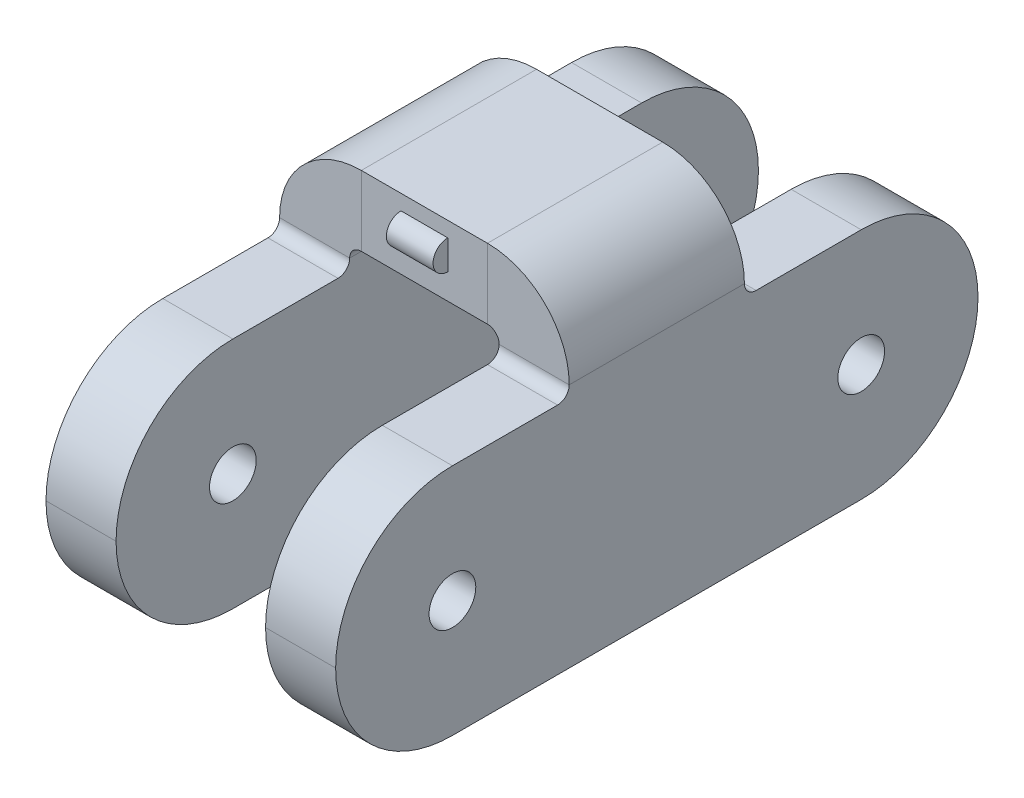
ISO-10303-21;
HEADER;
FILE_DESCRIPTION(('STEP AP214'),'2;1');
FILE_NAME('part.step','',(''),(''),'','','');
FILE_SCHEMA(('AUTOMOTIVE_DESIGN { 1 0 10303 214 1 1 1 1 }'));
ENDSEC;
DATA;
#1=APPLICATION_CONTEXT('core data for automotive mechanical design processes');
#2=APPLICATION_PROTOCOL_DEFINITION('international standard','automotive_design',2000,#1);
#3=PRODUCT_CONTEXT('',#1,'mechanical');
#4=PRODUCT('Part','Part','',(#3));
#5=PRODUCT_RELATED_PRODUCT_CATEGORY('part','',(#4));
#6=PRODUCT_DEFINITION_FORMATION('','',#4);
#7=PRODUCT_DEFINITION_CONTEXT('part definition',#1,'design');
#8=PRODUCT_DEFINITION('design','',#6,#7);
#9=PRODUCT_DEFINITION_SHAPE('','',#8);
#10=(LENGTH_UNIT() NAMED_UNIT(*) SI_UNIT(.MILLI.,.METRE.));
#11=(NAMED_UNIT(*) PLANE_ANGLE_UNIT() SI_UNIT($,.RADIAN.));
#12=(NAMED_UNIT(*) SI_UNIT($,.STERADIAN.) SOLID_ANGLE_UNIT());
#13=UNCERTAINTY_MEASURE_WITH_UNIT(LENGTH_MEASURE(1.E-05),#10,'distance_accuracy_value','');
#14=(GEOMETRIC_REPRESENTATION_CONTEXT(3) GLOBAL_UNCERTAINTY_ASSIGNED_CONTEXT((#13)) GLOBAL_UNIT_ASSIGNED_CONTEXT((#10,
#11,#12)) REPRESENTATION_CONTEXT('',''));
#15=CARTESIAN_POINT('',(0.,0.,0.));
#16=DIRECTION('',(0.,0.,1.));
#17=DIRECTION('',(1.,0.,0.));
#18=AXIS2_PLACEMENT_3D('',#15,#16,#17);
#19=CARTESIAN_POINT('',(6.20000000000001,5.,5.));
#20=DIRECTION('',(-1.,0.,0.));
#21=DIRECTION('',(0.,-1.,0.));
#22=AXIS2_PLACEMENT_3D('',#19,#20,#21);
#23=CYLINDRICAL_SURFACE('',#22,1.);
#24=CARTESIAN_POINT('',(6.20000000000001,5.,5.));
#25=DIRECTION('',(-1.,0.,0.));
#26=DIRECTION('',(0.,-1.,0.));
#27=AXIS2_PLACEMENT_3D('',#24,#25,#26);
#28=CIRCLE('',#27,1.);
#29=CARTESIAN_POINT('',(6.20000000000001,4.,5.));
#30=VERTEX_POINT('',#29);
#31=EDGE_CURVE('E393',#30,#30,#28,.T.);
#32=ORIENTED_EDGE('',*,*,#31,.F.);
#33=EDGE_LOOP('',(#32));
#34=FACE_BOUND('',#33,.T.);
#35=CARTESIAN_POINT('',(3.2,5.,5.));
#36=DIRECTION('',(1.,0.,0.));
#37=DIRECTION('',(0.,1.,0.));
#38=AXIS2_PLACEMENT_3D('',#35,#36,#37);
#39=CIRCLE('',#38,1.);
#40=CARTESIAN_POINT('',(3.2,6.,5.));
#41=VERTEX_POINT('',#40);
#42=EDGE_CURVE('E367',#41,#41,#39,.T.);
#43=ORIENTED_EDGE('',*,*,#42,.F.);
#44=EDGE_LOOP('',(#43));
#45=FACE_BOUND('',#44,.T.);
#46=ADVANCED_FACE('F28',(#34,#45),#23,.F.);
#47=CARTESIAN_POINT('',(6.19999999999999,0.,27.5));
#48=DIRECTION('',(1.,0.,0.));
#49=DIRECTION('',(0.,1.,0.));
#50=AXIS2_PLACEMENT_3D('',#47,#48,#49);
#51=PLANE('',#50);
#52=DIRECTION('',(0.,0.,-1.));
#53=VECTOR('',#52,1.);
#54=CARTESIAN_POINT('',(6.2,10.5,10.));
#55=LINE('',#54,#53);
#56=CARTESIAN_POINT('',(6.2,10.5,17.5));
#57=VERTEX_POINT('',#56);
#58=CARTESIAN_POINT('',(6.2,10.5,10.));
#59=VERTEX_POINT('',#58);
#60=EDGE_CURVE('E427',#57,#59,#55,.T.);
#61=ORIENTED_EDGE('',*,*,#60,.F.);
#62=CARTESIAN_POINT('',(6.2,10.5,18.));
#63=DIRECTION('',(1.,0.,0.));
#64=DIRECTION('',(0.,1.,0.));
#65=AXIS2_PLACEMENT_3D('',#62,#63,#64);
#66=CIRCLE('',#65,0.5);
#67=CARTESIAN_POINT('',(6.2,10.,18.));
#68=VERTEX_POINT('',#67);
#69=EDGE_CURVE('E409',#57,#68,#66,.F.);
#70=ORIENTED_EDGE('',*,*,#69,.T.);
#71=DIRECTION('',(0.,0.,1.));
#72=VECTOR('',#71,1.);
#73=CARTESIAN_POINT('',(6.2,9.99999999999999,27.5));
#74=LINE('',#73,#72);
#75=CARTESIAN_POINT('',(6.2,9.99999999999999,22.5));
#76=VERTEX_POINT('',#75);
#77=EDGE_CURVE('E412',#68,#76,#74,.T.);
#78=ORIENTED_EDGE('',*,*,#77,.T.);
#79=CARTESIAN_POINT('',(6.2,4.99999999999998,22.5));
#80=DIRECTION('',(1.,0.,0.));
#81=DIRECTION('',(0.,1.,0.));
#82=AXIS2_PLACEMENT_3D('',#79,#80,#81);
#83=CIRCLE('',#82,5.);
#84=CARTESIAN_POINT('',(6.2,4.99999999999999,27.5));
#85=VERTEX_POINT('',#84);
#86=EDGE_CURVE('E415',#76,#85,#83,.T.);
#87=ORIENTED_EDGE('',*,*,#86,.T.);
#88=CARTESIAN_POINT('',(6.2,4.99999999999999,22.5));
#89=DIRECTION('',(1.,0.,0.));
#90=DIRECTION('',(0.,1.,0.));
#91=AXIS2_PLACEMENT_3D('',#88,#89,#90);
#92=CIRCLE('',#91,5.);
#93=CARTESIAN_POINT('',(6.19999999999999,0.,22.5));
#94=VERTEX_POINT('',#93);
#95=EDGE_CURVE('E418',#85,#94,#92,.T.);
#96=ORIENTED_EDGE('',*,*,#95,.T.);
#97=DIRECTION('',(0.,0.,-1.));
#98=VECTOR('',#97,1.);
#99=CARTESIAN_POINT('',(6.19999999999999,0.,27.5));
#100=LINE('',#99,#98);
#101=CARTESIAN_POINT('',(6.19999999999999,0.,5.));
#102=VERTEX_POINT('',#101);
#103=EDGE_CURVE('E421',#94,#102,#100,.T.);
#104=ORIENTED_EDGE('',*,*,#103,.T.);
#105=CARTESIAN_POINT('',(6.2,5.,5.));
#106=DIRECTION('',(1.,0.,0.));
#107=DIRECTION('',(0.,1.,0.));
#108=AXIS2_PLACEMENT_3D('',#105,#106,#107);
#109=CIRCLE('',#108,5.);
#110=CARTESIAN_POINT('',(6.2,4.99999999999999,0.));
#111=VERTEX_POINT('',#110);
#112=EDGE_CURVE('E397',#102,#111,#109,.T.);
#113=ORIENTED_EDGE('',*,*,#112,.T.);
#114=CARTESIAN_POINT('',(6.2,5.,5.));
#115=DIRECTION('',(1.,0.,0.));
#116=DIRECTION('',(0.,1.,0.));
#117=AXIS2_PLACEMENT_3D('',#114,#115,#116);
#118=CIRCLE('',#117,5.);
#119=CARTESIAN_POINT('',(6.2,10.,5.));
#120=VERTEX_POINT('',#119);
#121=EDGE_CURVE('E400',#111,#120,#118,.T.);
#122=ORIENTED_EDGE('',*,*,#121,.T.);
#123=DIRECTION('',(0.,0.,1.));
#124=VECTOR('',#123,1.);
#125=CARTESIAN_POINT('',(6.2,9.99999999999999,0.));
#126=LINE('',#125,#124);
#127=CARTESIAN_POINT('',(6.2,9.99999999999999,9.5));
#128=VERTEX_POINT('',#127);
#129=EDGE_CURVE('E403',#120,#128,#126,.T.);
#130=ORIENTED_EDGE('',*,*,#129,.T.);
#131=CARTESIAN_POINT('',(6.2,10.5,9.5));
#132=DIRECTION('',(1.,0.,0.));
#133=DIRECTION('',(0.,1.,0.));
#134=AXIS2_PLACEMENT_3D('',#131,#132,#133);
#135=CIRCLE('',#134,0.5);
#136=EDGE_CURVE('E406',#128,#59,#135,.F.);
#137=ORIENTED_EDGE('',*,*,#136,.T.);
#138=EDGE_LOOP('',(#61,#70,#78,#87,#96,#104,#113,#122,#130,#137));
#139=FACE_BOUND('',#138,.T.);
#140=CARTESIAN_POINT('',(6.20000000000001,5.,22.5));
#141=DIRECTION('',(-1.,0.,0.));
#142=DIRECTION('',(0.,-1.,0.));
#143=AXIS2_PLACEMENT_3D('',#140,#141,#142);
#144=CIRCLE('',#143,1.);
#145=CARTESIAN_POINT('',(6.20000000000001,4.,22.5));
#146=VERTEX_POINT('',#145);
#147=EDGE_CURVE('E390',#146,#146,#144,.T.);
#148=ORIENTED_EDGE('',*,*,#147,.T.);
#149=EDGE_LOOP('',(#148));
#150=FACE_BOUND('',#149,.T.);
#151=ORIENTED_EDGE('',*,*,#31,.T.);
#152=EDGE_LOOP('',(#151));
#153=FACE_BOUND('',#152,.T.);
#154=ADVANCED_FACE('F461',(#139,#150,#153),#51,.T.);
#155=CARTESIAN_POINT('',(6.20000000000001,5.,22.5));
#156=DIRECTION('',(-1.,0.,0.));
#157=DIRECTION('',(0.,-1.,0.));
#158=AXIS2_PLACEMENT_3D('',#155,#156,#157);
#159=CYLINDRICAL_SURFACE('',#158,1.);
#160=ORIENTED_EDGE('',*,*,#147,.F.);
#161=EDGE_LOOP('',(#160));
#162=FACE_BOUND('',#161,.T.);
#163=CARTESIAN_POINT('',(3.2,4.99999999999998,22.5));
#164=DIRECTION('',(1.,0.,0.));
#165=DIRECTION('',(0.,1.,0.));
#166=AXIS2_PLACEMENT_3D('',#163,#164,#165);
#167=CIRCLE('',#166,1.);
#168=CARTESIAN_POINT('',(3.2,5.99999999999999,22.5));
#169=VERTEX_POINT('',#168);
#170=EDGE_CURVE('E364',#169,#169,#167,.T.);
#171=ORIENTED_EDGE('',*,*,#170,.F.);
#172=EDGE_LOOP('',(#171));
#173=FACE_BOUND('',#172,.T.);
#174=ADVANCED_FACE('F581',(#162,#173),#159,.F.);
#175=CARTESIAN_POINT('',(3.19999999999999,0.,27.5));
#176=DIRECTION('',(1.,0.,0.));
#177=DIRECTION('',(0.,1.,0.));
#178=AXIS2_PLACEMENT_3D('',#175,#176,#177);
#179=PLANE('',#178);
#180=ORIENTED_EDGE('',*,*,#170,.T.);
#181=EDGE_LOOP('',(#180));
#182=FACE_BOUND('',#181,.T.);
#183=ORIENTED_EDGE('',*,*,#42,.T.);
#184=EDGE_LOOP('',(#183));
#185=FACE_BOUND('',#184,.T.);
#186=CARTESIAN_POINT('',(3.2,10.5,18.));
#187=DIRECTION('',(1.,0.,0.));
#188=DIRECTION('',(0.,1.,0.));
#189=AXIS2_PLACEMENT_3D('',#186,#187,#188);
#190=CIRCLE('',#189,0.5);
#191=CARTESIAN_POINT('',(3.2,9.99999999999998,18.));
#192=VERTEX_POINT('',#191);
#193=CARTESIAN_POINT('',(3.2,10.5,17.5));
#194=VERTEX_POINT('',#193);
#195=EDGE_CURVE('E387',#192,#194,#190,.T.);
#196=ORIENTED_EDGE('',*,*,#195,.T.);
#197=DIRECTION('',(0.,0.,-1.));
#198=VECTOR('',#197,1.);
#199=CARTESIAN_POINT('',(3.2,10.5,10.));
#200=LINE('',#199,#198);
#201=CARTESIAN_POINT('',(3.2,10.5,9.99999999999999));
#202=VERTEX_POINT('',#201);
#203=EDGE_CURVE('E424',#194,#202,#200,.T.);
#204=ORIENTED_EDGE('',*,*,#203,.T.);
#205=CARTESIAN_POINT('',(3.2,10.5,9.5));
#206=DIRECTION('',(1.,0.,0.));
#207=DIRECTION('',(0.,1.,0.));
#208=AXIS2_PLACEMENT_3D('',#205,#206,#207);
#209=CIRCLE('',#208,0.5);
#210=CARTESIAN_POINT('',(3.2,10.,9.50000000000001));
#211=VERTEX_POINT('',#210);
#212=EDGE_CURVE('E370',#202,#211,#209,.T.);
#213=ORIENTED_EDGE('',*,*,#212,.T.);
#214=DIRECTION('',(0.,0.,-1.));
#215=VECTOR('',#214,1.);
#216=CARTESIAN_POINT('',(3.2,9.99999999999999,27.5));
#217=LINE('',#216,#215);
#218=CARTESIAN_POINT('',(3.2,10.,5.));
#219=VERTEX_POINT('',#218);
#220=EDGE_CURVE('E372',#211,#219,#217,.T.);
#221=ORIENTED_EDGE('',*,*,#220,.T.);
#222=CARTESIAN_POINT('',(3.2,5.,5.));
#223=DIRECTION('',(1.,0.,0.));
#224=DIRECTION('',(0.,1.,0.));
#225=AXIS2_PLACEMENT_3D('',#222,#223,#224);
#226=CIRCLE('',#225,5.);
#227=CARTESIAN_POINT('',(3.2,4.99999999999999,0.));
#228=VERTEX_POINT('',#227);
#229=EDGE_CURVE('E374',#219,#228,#226,.F.);
#230=ORIENTED_EDGE('',*,*,#229,.T.);
#231=CARTESIAN_POINT('',(3.2,5.,5.));
#232=DIRECTION('',(1.,0.,0.));
#233=DIRECTION('',(0.,1.,0.));
#234=AXIS2_PLACEMENT_3D('',#231,#232,#233);
#235=CIRCLE('',#234,5.);
#236=CARTESIAN_POINT('',(3.19999999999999,0.,5.));
#237=VERTEX_POINT('',#236);
#238=EDGE_CURVE('E376',#228,#237,#235,.F.);
#239=ORIENTED_EDGE('',*,*,#238,.T.);
#240=DIRECTION('',(0.,0.,-1.));
#241=VECTOR('',#240,1.);
#242=CARTESIAN_POINT('',(3.19999999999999,0.,27.5));
#243=LINE('',#242,#241);
#244=CARTESIAN_POINT('',(3.19999999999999,0.,22.5));
#245=VERTEX_POINT('',#244);
#246=EDGE_CURVE('E378',#245,#237,#243,.T.);
#247=ORIENTED_EDGE('',*,*,#246,.F.);
#248=CARTESIAN_POINT('',(3.2,4.99999999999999,22.5));
#249=DIRECTION('',(1.,0.,0.));
#250=DIRECTION('',(0.,1.,0.));
#251=AXIS2_PLACEMENT_3D('',#248,#249,#250);
#252=CIRCLE('',#251,5.);
#253=CARTESIAN_POINT('',(3.2,4.99999999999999,27.5));
#254=VERTEX_POINT('',#253);
#255=EDGE_CURVE('E381',#245,#254,#252,.F.);
#256=ORIENTED_EDGE('',*,*,#255,.T.);
#257=CARTESIAN_POINT('',(3.2,4.99999999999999,22.5));
#258=DIRECTION('',(1.,0.,0.));
#259=DIRECTION('',(0.,1.,0.));
#260=AXIS2_PLACEMENT_3D('',#257,#258,#259);
#261=CIRCLE('',#260,5.);
#262=CARTESIAN_POINT('',(3.2,9.99999999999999,22.5));
#263=VERTEX_POINT('',#262);
#264=EDGE_CURVE('E383',#254,#263,#261,.F.);
#265=ORIENTED_EDGE('',*,*,#264,.T.);
#266=DIRECTION('',(0.,0.,-1.));
#267=VECTOR('',#266,1.);
#268=CARTESIAN_POINT('',(3.2,10.,27.5));
#269=LINE('',#268,#267);
#270=EDGE_CURVE('E385',#263,#192,#269,.T.);
#271=ORIENTED_EDGE('',*,*,#270,.T.);
#272=EDGE_LOOP('',(#196,#204,#213,#221,#230,#239,#247,#256,#265,#271));
#273=FACE_BOUND('',#272,.T.);
#274=ADVANCED_FACE('F472',(#182,#185,#273),#179,.F.);
#275=CARTESIAN_POINT('',(-55.6727441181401,10.5,9.50000000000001));
#276=DIRECTION('',(1.,0.,0.));
#277=DIRECTION('',(0.,1.,0.));
#278=AXIS2_PLACEMENT_3D('',#275,#276,#277);
#279=CYLINDRICAL_SURFACE('',#278,0.5);
#280=ORIENTED_EDGE('',*,*,#136,.F.);
#281=DIRECTION('',(1.,0.,0.));
#282=VECTOR('',#281,1.);
#283=CARTESIAN_POINT('',(-55.6727441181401,10.,9.5));
#284=LINE('',#283,#282);
#285=EDGE_CURVE('E36',#211,#128,#284,.T.);
#286=ORIENTED_EDGE('',*,*,#285,.F.);
#287=ORIENTED_EDGE('',*,*,#212,.F.);
#288=DIRECTION('',(1.,0.,0.));
#289=VECTOR('',#288,1.);
#290=CARTESIAN_POINT('',(-55.6727441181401,10.5,10.));
#291=LINE('',#290,#289);
#292=EDGE_CURVE('E11',#202,#59,#291,.T.);
#293=ORIENTED_EDGE('',*,*,#292,.T.);
#294=EDGE_LOOP('',(#280,#286,#287,#293));
#295=FACE_BOUND('',#294,.T.);
#296=ADVANCED_FACE('F30',(#295),#279,.F.);
#297=CARTESIAN_POINT('',(-55.6727441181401,10.,27.5));
#298=DIRECTION('',(0.,-1.,0.));
#299=DIRECTION('',(1.,0.,0.));
#300=AXIS2_PLACEMENT_3D('',#297,#298,#299);
#301=PLANE('',#300);
#302=ORIENTED_EDGE('',*,*,#129,.F.);
#303=DIRECTION('',(1.,0.,0.));
#304=VECTOR('',#303,1.);
#305=CARTESIAN_POINT('',(-55.6727441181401,10.,5.));
#306=LINE('',#305,#304);
#307=EDGE_CURVE('E449',#219,#120,#306,.T.);
#308=ORIENTED_EDGE('',*,*,#307,.F.);
#309=ORIENTED_EDGE('',*,*,#220,.F.);
#310=ORIENTED_EDGE('',*,*,#285,.T.);
#311=EDGE_LOOP('',(#302,#308,#309,#310));
#312=FACE_BOUND('',#311,.T.);
#313=ADVANCED_FACE('F455',(#312),#301,.F.);
#314=CARTESIAN_POINT('',(-55.6727441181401,5.00000000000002,5.));
#315=DIRECTION('',(1.,0.,0.));
#316=DIRECTION('',(0.,1.,0.));
#317=AXIS2_PLACEMENT_3D('',#314,#315,#316);
#318=CYLINDRICAL_SURFACE('',#317,5.);
#319=ORIENTED_EDGE('',*,*,#121,.F.);
#320=DIRECTION('',(1.,0.,0.));
#321=VECTOR('',#320,1.);
#322=CARTESIAN_POINT('',(-55.6727441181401,5.00000000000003,0.));
#323=LINE('',#322,#321);
#324=EDGE_CURVE('E446',#228,#111,#323,.T.);
#325=ORIENTED_EDGE('',*,*,#324,.F.);
#326=ORIENTED_EDGE('',*,*,#229,.F.);
#327=ORIENTED_EDGE('',*,*,#307,.T.);
#328=EDGE_LOOP('',(#319,#325,#326,#327));
#329=FACE_BOUND('',#328,.T.);
#330=ADVANCED_FACE('F465',(#329),#318,.T.);
#331=CARTESIAN_POINT('',(-55.6727441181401,5.00000000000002,5.));
#332=DIRECTION('',(1.,0.,0.));
#333=DIRECTION('',(0.,1.,0.));
#334=AXIS2_PLACEMENT_3D('',#331,#332,#333);
#335=CYLINDRICAL_SURFACE('',#334,5.);
#336=ORIENTED_EDGE('',*,*,#112,.F.);
#337=DIRECTION('',(1.,0.,0.));
#338=VECTOR('',#337,1.);
#339=CARTESIAN_POINT('',(-55.6727441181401,0.,5.));
#340=LINE('',#339,#338);
#341=EDGE_CURVE('E443',#237,#102,#340,.T.);
#342=ORIENTED_EDGE('',*,*,#341,.F.);
#343=ORIENTED_EDGE('',*,*,#238,.F.);
#344=ORIENTED_EDGE('',*,*,#324,.T.);
#345=EDGE_LOOP('',(#336,#342,#343,#344));
#346=FACE_BOUND('',#345,.T.);
#347=ADVANCED_FACE('F469',(#346),#335,.T.);
#348=CARTESIAN_POINT('',(-55.6727441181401,0.,27.5));
#349=DIRECTION('',(0.,-1.,0.));
#350=DIRECTION('',(1.,0.,0.));
#351=AXIS2_PLACEMENT_3D('',#348,#349,#350);
#352=PLANE('',#351);
#353=ORIENTED_EDGE('',*,*,#341,.T.);
#354=ORIENTED_EDGE('',*,*,#103,.F.);
#355=DIRECTION('',(1.,0.,0.));
#356=VECTOR('',#355,1.);
#357=CARTESIAN_POINT('',(-55.6727441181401,0.,22.5));
#358=LINE('',#357,#356);
#359=EDGE_CURVE('E440',#245,#94,#358,.T.);
#360=ORIENTED_EDGE('',*,*,#359,.F.);
#361=ORIENTED_EDGE('',*,*,#246,.T.);
#362=EDGE_LOOP('',(#353,#354,#360,#361));
#363=FACE_BOUND('',#362,.T.);
#364=ADVANCED_FACE('F476',(#363),#352,.T.);
#365=CARTESIAN_POINT('',(-55.6727441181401,5.00000000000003,22.5));
#366=DIRECTION('',(1.,0.,0.));
#367=DIRECTION('',(0.,1.,0.));
#368=AXIS2_PLACEMENT_3D('',#365,#366,#367);
#369=CYLINDRICAL_SURFACE('',#368,5.);
#370=ORIENTED_EDGE('',*,*,#95,.F.);
#371=DIRECTION('',(1.,0.,0.));
#372=VECTOR('',#371,1.);
#373=CARTESIAN_POINT('',(-55.6727441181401,5.00000000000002,27.5));
#374=LINE('',#373,#372);
#375=EDGE_CURVE('E437',#254,#85,#374,.T.);
#376=ORIENTED_EDGE('',*,*,#375,.F.);
#377=ORIENTED_EDGE('',*,*,#255,.F.);
#378=ORIENTED_EDGE('',*,*,#359,.T.);
#379=EDGE_LOOP('',(#370,#376,#377,#378));
#380=FACE_BOUND('',#379,.T.);
#381=ADVANCED_FACE('F478',(#380),#369,.T.);
#382=CARTESIAN_POINT('',(-55.6727441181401,5.00000000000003,22.5));
#383=DIRECTION('',(1.,0.,0.));
#384=DIRECTION('',(0.,1.,0.));
#385=AXIS2_PLACEMENT_3D('',#382,#383,#384);
#386=CYLINDRICAL_SURFACE('',#385,5.);
#387=ORIENTED_EDGE('',*,*,#86,.F.);
#388=DIRECTION('',(1.,0.,0.));
#389=VECTOR('',#388,1.);
#390=CARTESIAN_POINT('',(-55.6727441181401,10.,22.5));
#391=LINE('',#390,#389);
#392=EDGE_CURVE('E434',#263,#76,#391,.T.);
#393=ORIENTED_EDGE('',*,*,#392,.F.);
#394=ORIENTED_EDGE('',*,*,#264,.F.);
#395=ORIENTED_EDGE('',*,*,#375,.T.);
#396=EDGE_LOOP('',(#387,#393,#394,#395));
#397=FACE_BOUND('',#396,.T.);
#398=ADVANCED_FACE('F483',(#397),#386,.T.);
#399=CARTESIAN_POINT('',(-55.6727441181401,10.,27.5));
#400=DIRECTION('',(0.,-1.,0.));
#401=DIRECTION('',(0.,0.,-1.));
#402=AXIS2_PLACEMENT_3D('',#399,#400,#401);
#403=PLANE('',#402);
#404=ORIENTED_EDGE('',*,*,#77,.F.);
#405=DIRECTION('',(1.,0.,0.));
#406=VECTOR('',#405,1.);
#407=CARTESIAN_POINT('',(-55.6727441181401,10.,18.));
#408=LINE('',#407,#406);
#409=EDGE_CURVE('E432',#192,#68,#408,.T.);
#410=ORIENTED_EDGE('',*,*,#409,.F.);
#411=ORIENTED_EDGE('',*,*,#270,.F.);
#412=ORIENTED_EDGE('',*,*,#392,.T.);
#413=EDGE_LOOP('',(#404,#410,#411,#412));
#414=FACE_BOUND('',#413,.T.);
#415=ADVANCED_FACE('F487',(#414),#403,.F.);
#416=CARTESIAN_POINT('',(-55.6727441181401,10.5,18.));
#417=DIRECTION('',(1.,0.,0.));
#418=DIRECTION('',(0.,1.,0.));
#419=AXIS2_PLACEMENT_3D('',#416,#417,#418);
#420=CYLINDRICAL_SURFACE('',#419,0.5);
#421=ORIENTED_EDGE('',*,*,#69,.F.);
#422=DIRECTION('',(1.,0.,0.));
#423=VECTOR('',#422,1.);
#424=CARTESIAN_POINT('',(-55.6727441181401,10.5,17.5));
#425=LINE('',#424,#423);
#426=EDGE_CURVE('E430',#194,#57,#425,.T.);
#427=ORIENTED_EDGE('',*,*,#426,.F.);
#428=ORIENTED_EDGE('',*,*,#195,.F.);
#429=ORIENTED_EDGE('',*,*,#409,.T.);
#430=EDGE_LOOP('',(#421,#427,#428,#429));
#431=FACE_BOUND('',#430,.T.);
#432=ADVANCED_FACE('F493',(#431),#420,.F.);
#433=CARTESIAN_POINT('',(6.20000000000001,5.,5.));
#434=DIRECTION('',(-1.,0.,0.));
#435=DIRECTION('',(0.,-1.,0.));
#436=AXIS2_PLACEMENT_3D('',#433,#434,#435);
#437=CYLINDRICAL_SURFACE('',#436,1.);
#438=CARTESIAN_POINT('',(-6.19999999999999,4.99999999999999,5.00000000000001));
#439=DIRECTION('',(-1.,0.,0.));
#440=DIRECTION('',(0.,-1.,0.));
#441=AXIS2_PLACEMENT_3D('',#438,#439,#440);
#442=CIRCLE('',#441,1.);
#443=CARTESIAN_POINT('',(-6.19999999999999,3.99999999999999,5.00000000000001));
#444=VERTEX_POINT('',#443);
#445=EDGE_CURVE('E302',#444,#444,#442,.T.);
#446=ORIENTED_EDGE('',*,*,#445,.T.);
#447=EDGE_LOOP('',(#446));
#448=FACE_BOUND('',#447,.T.);
#449=CARTESIAN_POINT('',(-3.2,4.99999999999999,5.00000000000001));
#450=DIRECTION('',(-1.,0.,0.));
#451=DIRECTION('',(0.,-1.,0.));
#452=AXIS2_PLACEMENT_3D('',#449,#450,#451);
#453=CIRCLE('',#452,1.);
#454=CARTESIAN_POINT('',(-3.2,3.99999999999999,5.00000000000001));
#455=VERTEX_POINT('',#454);
#456=EDGE_CURVE('E277',#455,#455,#453,.T.);
#457=ORIENTED_EDGE('',*,*,#456,.F.);
#458=EDGE_LOOP('',(#457));
#459=FACE_BOUND('',#458,.T.);
#460=ADVANCED_FACE('F602',(#448,#459),#437,.F.);
#461=CARTESIAN_POINT('',(-6.19999999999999,0.,27.5));
#462=DIRECTION('',(-1.,0.,0.));
#463=DIRECTION('',(0.,-1.,0.));
#464=AXIS2_PLACEMENT_3D('',#461,#462,#463);
#465=PLANE('',#464);
#466=DIRECTION('',(0.,0.,1.));
#467=VECTOR('',#466,1.);
#468=CARTESIAN_POINT('',(-6.2,10.5,17.5));
#469=LINE('',#468,#467);
#470=CARTESIAN_POINT('',(-6.2,10.5,10.));
#471=VERTEX_POINT('',#470);
#472=CARTESIAN_POINT('',(-6.2,10.5,17.5));
#473=VERTEX_POINT('',#472);
#474=EDGE_CURVE('E333',#471,#473,#469,.T.);
#475=ORIENTED_EDGE('',*,*,#474,.F.);
#476=CARTESIAN_POINT('',(-6.2,10.5,9.5));
#477=DIRECTION('',(-1.,0.,0.));
#478=DIRECTION('',(0.,-1.,0.));
#479=AXIS2_PLACEMENT_3D('',#476,#477,#478);
#480=CIRCLE('',#479,0.5);
#481=CARTESIAN_POINT('',(-6.2,10.,9.50000000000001));
#482=VERTEX_POINT('',#481);
#483=EDGE_CURVE('E327',#471,#482,#480,.F.);
#484=ORIENTED_EDGE('',*,*,#483,.T.);
#485=DIRECTION('',(0.,0.,1.));
#486=VECTOR('',#485,1.);
#487=CARTESIAN_POINT('',(-6.2,9.99999999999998,0.));
#488=LINE('',#487,#486);
#489=CARTESIAN_POINT('',(-6.2,9.99999999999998,5.));
#490=VERTEX_POINT('',#489);
#491=EDGE_CURVE('E305',#490,#482,#488,.T.);
#492=ORIENTED_EDGE('',*,*,#491,.F.);
#493=CARTESIAN_POINT('',(-6.19999999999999,4.99999999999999,5.00000000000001));
#494=DIRECTION('',(-1.,0.,0.));
#495=DIRECTION('',(0.,-1.,0.));
#496=AXIS2_PLACEMENT_3D('',#493,#494,#495);
#497=CIRCLE('',#496,5.);
#498=CARTESIAN_POINT('',(-6.19999999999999,4.99999999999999,0.));
#499=VERTEX_POINT('',#498);
#500=EDGE_CURVE('E308',#490,#499,#497,.T.);
#501=ORIENTED_EDGE('',*,*,#500,.T.);
#502=CARTESIAN_POINT('',(-6.19999999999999,5.,5.));
#503=DIRECTION('',(-1.,0.,0.));
#504=DIRECTION('',(0.,-1.,0.));
#505=AXIS2_PLACEMENT_3D('',#502,#503,#504);
#506=CIRCLE('',#505,5.);
#507=CARTESIAN_POINT('',(-6.19999999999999,0.,5.));
#508=VERTEX_POINT('',#507);
#509=EDGE_CURVE('E311',#499,#508,#506,.T.);
#510=ORIENTED_EDGE('',*,*,#509,.T.);
#511=DIRECTION('',(0.,0.,-1.));
#512=VECTOR('',#511,1.);
#513=CARTESIAN_POINT('',(-6.19999999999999,0.,27.5));
#514=LINE('',#513,#512);
#515=CARTESIAN_POINT('',(-6.19999999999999,0.,22.5));
#516=VERTEX_POINT('',#515);
#517=EDGE_CURVE('E314',#516,#508,#514,.T.);
#518=ORIENTED_EDGE('',*,*,#517,.F.);
#519=CARTESIAN_POINT('',(-6.19999999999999,4.99999999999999,22.5));
#520=DIRECTION('',(-1.,0.,0.));
#521=DIRECTION('',(0.,-1.,0.));
#522=AXIS2_PLACEMENT_3D('',#519,#520,#521);
#523=CIRCLE('',#522,5.);
#524=CARTESIAN_POINT('',(-6.19999999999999,4.99999999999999,27.5));
#525=VERTEX_POINT('',#524);
#526=EDGE_CURVE('E316',#516,#525,#523,.T.);
#527=ORIENTED_EDGE('',*,*,#526,.T.);
#528=CARTESIAN_POINT('',(-6.19999999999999,4.99999999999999,22.5));
#529=DIRECTION('',(-1.,0.,0.));
#530=DIRECTION('',(0.,-1.,0.));
#531=AXIS2_PLACEMENT_3D('',#528,#529,#530);
#532=CIRCLE('',#531,5.);
#533=CARTESIAN_POINT('',(-6.2,9.99999999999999,22.5));
#534=VERTEX_POINT('',#533);
#535=EDGE_CURVE('E319',#525,#534,#532,.T.);
#536=ORIENTED_EDGE('',*,*,#535,.T.);
#537=DIRECTION('',(0.,0.,1.));
#538=VECTOR('',#537,1.);
#539=CARTESIAN_POINT('',(-6.2,9.99999999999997,27.5));
#540=LINE('',#539,#538);
#541=CARTESIAN_POINT('',(-6.2,9.99999999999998,18.));
#542=VERTEX_POINT('',#541);
#543=EDGE_CURVE('E322',#542,#534,#540,.T.);
#544=ORIENTED_EDGE('',*,*,#543,.F.);
#545=CARTESIAN_POINT('',(-6.2,10.5,18.));
#546=DIRECTION('',(-1.,0.,0.));
#547=DIRECTION('',(0.,-1.,0.));
#548=AXIS2_PLACEMENT_3D('',#545,#546,#547);
#549=CIRCLE('',#548,0.5);
#550=EDGE_CURVE('E324',#542,#473,#549,.F.);
#551=ORIENTED_EDGE('',*,*,#550,.T.);
#552=EDGE_LOOP('',(#475,#484,#492,#501,#510,#518,#527,#536,#544,#551));
#553=FACE_BOUND('',#552,.T.);
#554=CARTESIAN_POINT('',(-6.19999999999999,4.99999999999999,22.5));
#555=DIRECTION('',(-1.,0.,0.));
#556=DIRECTION('',(0.,-1.,0.));
#557=AXIS2_PLACEMENT_3D('',#554,#555,#556);
#558=CIRCLE('',#557,1.);
#559=CARTESIAN_POINT('',(-6.19999999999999,3.99999999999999,22.5));
#560=VERTEX_POINT('',#559);
#561=EDGE_CURVE('E299',#560,#560,#558,.T.);
#562=ORIENTED_EDGE('',*,*,#561,.F.);
#563=EDGE_LOOP('',(#562));
#564=FACE_BOUND('',#563,.T.);
#565=ORIENTED_EDGE('',*,*,#445,.F.);
#566=EDGE_LOOP('',(#565));
#567=FACE_BOUND('',#566,.T.);
#568=ADVANCED_FACE('F541',(#553,#564,#567),#465,.T.);
#569=CARTESIAN_POINT('',(6.20000000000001,4.99999999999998,22.5));
#570=DIRECTION('',(-1.,0.,0.));
#571=DIRECTION('',(0.,-1.,0.));
#572=AXIS2_PLACEMENT_3D('',#569,#570,#571);
#573=CYLINDRICAL_SURFACE('',#572,1.);
#574=ORIENTED_EDGE('',*,*,#561,.T.);
#575=EDGE_LOOP('',(#574));
#576=FACE_BOUND('',#575,.T.);
#577=CARTESIAN_POINT('',(-3.2,4.99999999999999,22.5));
#578=DIRECTION('',(-1.,0.,0.));
#579=DIRECTION('',(0.,-1.,0.));
#580=AXIS2_PLACEMENT_3D('',#577,#578,#579);
#581=CIRCLE('',#580,1.);
#582=CARTESIAN_POINT('',(-3.2,3.99999999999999,22.5));
#583=VERTEX_POINT('',#582);
#584=EDGE_CURVE('E274',#583,#583,#581,.T.);
#585=ORIENTED_EDGE('',*,*,#584,.F.);
#586=EDGE_LOOP('',(#585));
#587=FACE_BOUND('',#586,.T.);
#588=ADVANCED_FACE('F660',(#576,#587),#573,.F.);
#589=CARTESIAN_POINT('',(-3.19999999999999,0.,27.5));
#590=DIRECTION('',(-1.,0.,0.));
#591=DIRECTION('',(0.,-1.,0.));
#592=AXIS2_PLACEMENT_3D('',#589,#590,#591);
#593=PLANE('',#592);
#594=ORIENTED_EDGE('',*,*,#584,.T.);
#595=EDGE_LOOP('',(#594));
#596=FACE_BOUND('',#595,.T.);
#597=ORIENTED_EDGE('',*,*,#456,.T.);
#598=EDGE_LOOP('',(#597));
#599=FACE_BOUND('',#598,.T.);
#600=CARTESIAN_POINT('',(-3.2,10.5,9.5));
#601=DIRECTION('',(-1.,0.,0.));
#602=DIRECTION('',(0.,-1.,0.));
#603=AXIS2_PLACEMENT_3D('',#600,#601,#602);
#604=CIRCLE('',#603,0.5);
#605=CARTESIAN_POINT('',(-3.2,9.99999999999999,9.5));
#606=VERTEX_POINT('',#605);
#607=CARTESIAN_POINT('',(-3.2,10.5,10.));
#608=VERTEX_POINT('',#607);
#609=EDGE_CURVE('E286',#606,#608,#604,.T.);
#610=ORIENTED_EDGE('',*,*,#609,.T.);
#611=DIRECTION('',(0.,0.,1.));
#612=VECTOR('',#611,1.);
#613=CARTESIAN_POINT('',(-3.2,10.5,17.5));
#614=LINE('',#613,#612);
#615=CARTESIAN_POINT('',(-3.2,10.5,17.5));
#616=VERTEX_POINT('',#615);
#617=EDGE_CURVE('E330',#608,#616,#614,.T.);
#618=ORIENTED_EDGE('',*,*,#617,.T.);
#619=CARTESIAN_POINT('',(-3.2,10.5,18.));
#620=DIRECTION('',(-1.,0.,0.));
#621=DIRECTION('',(0.,-1.,0.));
#622=AXIS2_PLACEMENT_3D('',#619,#620,#621);
#623=CIRCLE('',#622,0.5);
#624=CARTESIAN_POINT('',(-3.2,9.99999999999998,18.));
#625=VERTEX_POINT('',#624);
#626=EDGE_CURVE('E289',#616,#625,#623,.T.);
#627=ORIENTED_EDGE('',*,*,#626,.T.);
#628=DIRECTION('',(0.,0.,1.));
#629=VECTOR('',#628,1.);
#630=CARTESIAN_POINT('',(-3.2,9.99999999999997,27.5));
#631=LINE('',#630,#629);
#632=CARTESIAN_POINT('',(-3.2,9.99999999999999,22.5));
#633=VERTEX_POINT('',#632);
#634=EDGE_CURVE('E291',#625,#633,#631,.T.);
#635=ORIENTED_EDGE('',*,*,#634,.T.);
#636=CARTESIAN_POINT('',(-3.2,4.99999999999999,22.5));
#637=DIRECTION('',(-1.,0.,0.));
#638=DIRECTION('',(0.,-1.,0.));
#639=AXIS2_PLACEMENT_3D('',#636,#637,#638);
#640=CIRCLE('',#639,5.);
#641=CARTESIAN_POINT('',(-3.2,4.99999999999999,27.5));
#642=VERTEX_POINT('',#641);
#643=EDGE_CURVE('E293',#633,#642,#640,.F.);
#644=ORIENTED_EDGE('',*,*,#643,.T.);
#645=CARTESIAN_POINT('',(-3.2,4.99999999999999,22.5));
#646=DIRECTION('',(-1.,0.,0.));
#647=DIRECTION('',(0.,-1.,0.));
#648=AXIS2_PLACEMENT_3D('',#645,#646,#647);
#649=CIRCLE('',#648,5.);
#650=CARTESIAN_POINT('',(-3.19999999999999,0.,22.5));
#651=VERTEX_POINT('',#650);
#652=EDGE_CURVE('E295',#642,#651,#649,.F.);
#653=ORIENTED_EDGE('',*,*,#652,.T.);
#654=DIRECTION('',(0.,0.,-1.));
#655=VECTOR('',#654,1.);
#656=CARTESIAN_POINT('',(-3.19999999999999,0.,27.5));
#657=LINE('',#656,#655);
#658=CARTESIAN_POINT('',(-3.19999999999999,0.,5.));
#659=VERTEX_POINT('',#658);
#660=EDGE_CURVE('E297',#651,#659,#657,.T.);
#661=ORIENTED_EDGE('',*,*,#660,.T.);
#662=CARTESIAN_POINT('',(-3.2,5.,5.));
#663=DIRECTION('',(-1.,0.,0.));
#664=DIRECTION('',(0.,-1.,0.));
#665=AXIS2_PLACEMENT_3D('',#662,#663,#664);
#666=CIRCLE('',#665,5.);
#667=CARTESIAN_POINT('',(-3.2,4.99999999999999,0.));
#668=VERTEX_POINT('',#667);
#669=EDGE_CURVE('E280',#659,#668,#666,.F.);
#670=ORIENTED_EDGE('',*,*,#669,.T.);
#671=CARTESIAN_POINT('',(-3.19999999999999,5.,5.));
#672=DIRECTION('',(-1.,0.,0.));
#673=DIRECTION('',(0.,-1.,0.));
#674=AXIS2_PLACEMENT_3D('',#671,#672,#673);
#675=CIRCLE('',#674,5.);
#676=CARTESIAN_POINT('',(-3.2,9.99999999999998,5.));
#677=VERTEX_POINT('',#676);
#678=EDGE_CURVE('E282',#668,#677,#675,.F.);
#679=ORIENTED_EDGE('',*,*,#678,.T.);
#680=DIRECTION('',(0.,0.,1.));
#681=VECTOR('',#680,1.);
#682=CARTESIAN_POINT('',(-3.2,9.99999999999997,27.5));
#683=LINE('',#682,#681);
#684=EDGE_CURVE('E284',#677,#606,#683,.T.);
#685=ORIENTED_EDGE('',*,*,#684,.T.);
#686=EDGE_LOOP('',(#610,#618,#627,#635,#644,#653,#661,#670,#679,#685));
#687=FACE_BOUND('',#686,.T.);
#688=ADVANCED_FACE('F528',(#596,#599,#687),#593,.F.);
#689=CARTESIAN_POINT('',(55.6727441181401,10.5,18.));
#690=DIRECTION('',(-1.,0.,0.));
#691=DIRECTION('',(0.,-1.,0.));
#692=AXIS2_PLACEMENT_3D('',#689,#690,#691);
#693=CYLINDRICAL_SURFACE('',#692,0.5);
#694=ORIENTED_EDGE('',*,*,#550,.F.);
#695=DIRECTION('',(-1.,0.,0.));
#696=VECTOR('',#695,1.);
#697=CARTESIAN_POINT('',(55.6727441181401,10.,18.));
#698=LINE('',#697,#696);
#699=EDGE_CURVE('E358',#625,#542,#698,.T.);
#700=ORIENTED_EDGE('',*,*,#699,.F.);
#701=ORIENTED_EDGE('',*,*,#626,.F.);
#702=DIRECTION('',(-1.,0.,0.));
#703=VECTOR('',#702,1.);
#704=CARTESIAN_POINT('',(55.6727441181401,10.5,17.5));
#705=LINE('',#704,#703);
#706=EDGE_CURVE('E361',#616,#473,#705,.T.);
#707=ORIENTED_EDGE('',*,*,#706,.T.);
#708=EDGE_LOOP('',(#694,#700,#701,#707));
#709=FACE_BOUND('',#708,.T.);
#710=ADVANCED_FACE('F534',(#709),#693,.F.);
#711=CARTESIAN_POINT('',(55.6727441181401,10.,27.5));
#712=DIRECTION('',(0.,-1.,0.));
#713=DIRECTION('',(0.,0.,1.));
#714=AXIS2_PLACEMENT_3D('',#711,#712,#713);
#715=PLANE('',#714);
#716=ORIENTED_EDGE('',*,*,#543,.T.);
#717=DIRECTION('',(-1.,0.,0.));
#718=VECTOR('',#717,1.);
#719=CARTESIAN_POINT('',(55.6727441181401,10.,22.5));
#720=LINE('',#719,#718);
#721=EDGE_CURVE('E355',#633,#534,#720,.T.);
#722=ORIENTED_EDGE('',*,*,#721,.F.);
#723=ORIENTED_EDGE('',*,*,#634,.F.);
#724=ORIENTED_EDGE('',*,*,#699,.T.);
#725=EDGE_LOOP('',(#716,#722,#723,#724));
#726=FACE_BOUND('',#725,.T.);
#727=ADVANCED_FACE('F537',(#726),#715,.F.);
#728=CARTESIAN_POINT('',(55.6727441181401,5.00000000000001,22.5));
#729=DIRECTION('',(-1.,0.,0.));
#730=DIRECTION('',(0.,-1.,0.));
#731=AXIS2_PLACEMENT_3D('',#728,#729,#730);
#732=CYLINDRICAL_SURFACE('',#731,5.);
#733=ORIENTED_EDGE('',*,*,#535,.F.);
#734=DIRECTION('',(-1.,0.,0.));
#735=VECTOR('',#734,1.);
#736=CARTESIAN_POINT('',(55.6727441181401,5.00000000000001,27.5));
#737=LINE('',#736,#735);
#738=EDGE_CURVE('E352',#642,#525,#737,.T.);
#739=ORIENTED_EDGE('',*,*,#738,.F.);
#740=ORIENTED_EDGE('',*,*,#643,.F.);
#741=ORIENTED_EDGE('',*,*,#721,.T.);
#742=EDGE_LOOP('',(#733,#739,#740,#741));
#743=FACE_BOUND('',#742,.T.);
#744=ADVANCED_FACE('F546',(#743),#732,.T.);
#745=CARTESIAN_POINT('',(55.6727441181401,5.00000000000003,22.5));
#746=DIRECTION('',(-1.,0.,0.));
#747=DIRECTION('',(0.,-1.,0.));
#748=AXIS2_PLACEMENT_3D('',#745,#746,#747);
#749=CYLINDRICAL_SURFACE('',#748,5.);
#750=ORIENTED_EDGE('',*,*,#526,.F.);
#751=DIRECTION('',(-1.,0.,0.));
#752=VECTOR('',#751,1.);
#753=CARTESIAN_POINT('',(55.6727441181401,0.,22.5));
#754=LINE('',#753,#752);
#755=EDGE_CURVE('E349',#651,#516,#754,.T.);
#756=ORIENTED_EDGE('',*,*,#755,.F.);
#757=ORIENTED_EDGE('',*,*,#652,.F.);
#758=ORIENTED_EDGE('',*,*,#738,.T.);
#759=EDGE_LOOP('',(#750,#756,#757,#758));
#760=FACE_BOUND('',#759,.T.);
#761=ADVANCED_FACE('F550',(#760),#749,.T.);
#762=CARTESIAN_POINT('',(55.6727441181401,0.,27.5));
#763=DIRECTION('',(0.,1.,0.));
#764=DIRECTION('',(-1.,0.,0.));
#765=AXIS2_PLACEMENT_3D('',#762,#763,#764);
#766=PLANE('',#765);
#767=ORIENTED_EDGE('',*,*,#517,.T.);
#768=DIRECTION('',(-1.,0.,0.));
#769=VECTOR('',#768,1.);
#770=CARTESIAN_POINT('',(55.6727441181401,0.,5.));
#771=LINE('',#770,#769);
#772=EDGE_CURVE('E346',#659,#508,#771,.T.);
#773=ORIENTED_EDGE('',*,*,#772,.F.);
#774=ORIENTED_EDGE('',*,*,#660,.F.);
#775=ORIENTED_EDGE('',*,*,#755,.T.);
#776=EDGE_LOOP('',(#767,#773,#774,#775));
#777=FACE_BOUND('',#776,.T.);
#778=ADVANCED_FACE('F556',(#777),#766,.F.);
#779=CARTESIAN_POINT('',(55.6727441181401,5.00000000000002,5.));
#780=DIRECTION('',(-1.,0.,0.));
#781=DIRECTION('',(0.,-1.,0.));
#782=AXIS2_PLACEMENT_3D('',#779,#780,#781);
#783=CYLINDRICAL_SURFACE('',#782,5.);
#784=ORIENTED_EDGE('',*,*,#509,.F.);
#785=DIRECTION('',(-1.,0.,0.));
#786=VECTOR('',#785,1.);
#787=CARTESIAN_POINT('',(55.6727441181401,5.00000000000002,0.));
#788=LINE('',#787,#786);
#789=EDGE_CURVE('E343',#668,#499,#788,.T.);
#790=ORIENTED_EDGE('',*,*,#789,.F.);
#791=ORIENTED_EDGE('',*,*,#669,.F.);
#792=ORIENTED_EDGE('',*,*,#772,.T.);
#793=EDGE_LOOP('',(#784,#790,#791,#792));
#794=FACE_BOUND('',#793,.T.);
#795=ADVANCED_FACE('F558',(#794),#783,.T.);
#796=CARTESIAN_POINT('',(55.6727441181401,5.00000000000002,5.));
#797=DIRECTION('',(-1.,0.,0.));
#798=DIRECTION('',(0.,-1.,0.));
#799=AXIS2_PLACEMENT_3D('',#796,#797,#798);
#800=CYLINDRICAL_SURFACE('',#799,5.);
#801=ORIENTED_EDGE('',*,*,#500,.F.);
#802=DIRECTION('',(-1.,0.,0.));
#803=VECTOR('',#802,1.);
#804=CARTESIAN_POINT('',(55.6727441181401,10.,5.));
#805=LINE('',#804,#803);
#806=EDGE_CURVE('E340',#677,#490,#805,.T.);
#807=ORIENTED_EDGE('',*,*,#806,.F.);
#808=ORIENTED_EDGE('',*,*,#678,.F.);
#809=ORIENTED_EDGE('',*,*,#789,.T.);
#810=EDGE_LOOP('',(#801,#807,#808,#809));
#811=FACE_BOUND('',#810,.T.);
#812=ADVANCED_FACE('F563',(#811),#800,.T.);
#813=CARTESIAN_POINT('',(55.6727441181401,10.,27.5));
#814=DIRECTION('',(0.,-1.,0.));
#815=DIRECTION('',(1.,0.,0.));
#816=AXIS2_PLACEMENT_3D('',#813,#814,#815);
#817=PLANE('',#816);
#818=ORIENTED_EDGE('',*,*,#491,.T.);
#819=DIRECTION('',(-1.,0.,0.));
#820=VECTOR('',#819,1.);
#821=CARTESIAN_POINT('',(55.6727441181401,10.,9.5));
#822=LINE('',#821,#820);
#823=EDGE_CURVE('E338',#606,#482,#822,.T.);
#824=ORIENTED_EDGE('',*,*,#823,.F.);
#825=ORIENTED_EDGE('',*,*,#684,.F.);
#826=ORIENTED_EDGE('',*,*,#806,.T.);
#827=EDGE_LOOP('',(#818,#824,#825,#826));
#828=FACE_BOUND('',#827,.T.);
#829=ADVANCED_FACE('F567',(#828),#817,.F.);
#830=CARTESIAN_POINT('',(55.6727441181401,10.5,9.50000000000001));
#831=DIRECTION('',(-1.,0.,0.));
#832=DIRECTION('',(0.,-1.,0.));
#833=AXIS2_PLACEMENT_3D('',#830,#831,#832);
#834=CYLINDRICAL_SURFACE('',#833,0.5);
#835=ORIENTED_EDGE('',*,*,#483,.F.);
#836=DIRECTION('',(-1.,0.,0.));
#837=VECTOR('',#836,1.);
#838=CARTESIAN_POINT('',(55.6727441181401,10.5,10.));
#839=LINE('',#838,#837);
#840=EDGE_CURVE('E336',#608,#471,#839,.T.);
#841=ORIENTED_EDGE('',*,*,#840,.F.);
#842=ORIENTED_EDGE('',*,*,#609,.F.);
#843=ORIENTED_EDGE('',*,*,#823,.T.);
#844=EDGE_LOOP('',(#835,#841,#842,#843));
#845=FACE_BOUND('',#844,.T.);
#846=ADVANCED_FACE('F570',(#845),#834,.F.);
#847=CARTESIAN_POINT('',(3.2,-7.48350616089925,10.));
#848=DIRECTION('',(0.,0.,1.));
#849=DIRECTION('',(1.,0.,0.));
#850=AXIS2_PLACEMENT_3D('',#847,#848,#849);
#851=PLANE('',#850);
#852=DIRECTION('',(-1.,0.,0.));
#853=VECTOR('',#852,1.);
#854=CARTESIAN_POINT('',(6.2,14.,10.));
#855=LINE('',#854,#853);
#856=CARTESIAN_POINT('',(2.7,14.,9.99999999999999));
#857=VERTEX_POINT('',#856);
#858=CARTESIAN_POINT('',(-2.7,14.,10.));
#859=VERTEX_POINT('',#858);
#860=EDGE_CURVE('E243',#857,#859,#855,.T.);
#861=ORIENTED_EDGE('',*,*,#860,.F.);
#862=DIRECTION('',(0.,1.,0.));
#863=VECTOR('',#862,1.);
#864=CARTESIAN_POINT('',(2.7,-7.48350616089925,10.));
#865=LINE('',#864,#863);
#866=CARTESIAN_POINT('',(2.7,11.,9.99999999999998));
#867=VERTEX_POINT('',#866);
#868=EDGE_CURVE('E266',#867,#857,#865,.T.);
#869=ORIENTED_EDGE('',*,*,#868,.F.);
#870=DIRECTION('',(1.,0.,0.));
#871=VECTOR('',#870,1.);
#872=CARTESIAN_POINT('',(3.2,11.,9.99999999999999));
#873=LINE('',#872,#871);
#874=CARTESIAN_POINT('',(-2.7,11.,10.));
#875=VERTEX_POINT('',#874);
#876=EDGE_CURVE('E252',#875,#867,#873,.T.);
#877=ORIENTED_EDGE('',*,*,#876,.F.);
#878=DIRECTION('',(0.,1.,0.));
#879=VECTOR('',#878,1.);
#880=CARTESIAN_POINT('',(-2.7,-7.48350616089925,10.));
#881=LINE('',#880,#879);
#882=EDGE_CURVE('E258',#875,#859,#881,.T.);
#883=ORIENTED_EDGE('',*,*,#882,.T.);
#884=EDGE_LOOP('',(#861,#869,#877,#883));
#885=FACE_BOUND('',#884,.T.);
#886=ADVANCED_FACE('F512',(#885),#851,.F.);
#887=CARTESIAN_POINT('',(3.2,-7.48350616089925,17.5));
#888=DIRECTION('',(0.,0.,-1.));
#889=DIRECTION('',(-1.,0.,0.));
#890=AXIS2_PLACEMENT_3D('',#887,#888,#889);
#891=PLANE('',#890);
#892=DIRECTION('',(-1.,0.,0.));
#893=VECTOR('',#892,1.);
#894=CARTESIAN_POINT('',(1.,13.3500228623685,17.5));
#895=LINE('',#894,#893);
#896=CARTESIAN_POINT('',(1.,13.3500228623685,17.5));
#897=VERTEX_POINT('',#896);
#898=CARTESIAN_POINT('',(-1.,13.3500228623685,17.5));
#899=VERTEX_POINT('',#898);
#900=EDGE_CURVE('E48',#897,#899,#895,.T.);
#901=ORIENTED_EDGE('',*,*,#900,.F.);
#902=DIRECTION('',(0.,1.,0.));
#903=VECTOR('',#902,1.);
#904=CARTESIAN_POINT('',(1.,13.3500228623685,17.5));
#905=LINE('',#904,#903);
#906=CARTESIAN_POINT('',(1.,12.0925925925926,17.5));
#907=VERTEX_POINT('',#906);
#908=EDGE_CURVE('E43',#907,#897,#905,.T.);
#909=ORIENTED_EDGE('',*,*,#908,.F.);
#910=DIRECTION('',(-1.,0.,0.));
#911=VECTOR('',#910,1.);
#912=CARTESIAN_POINT('',(1.,12.0925925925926,17.5));
#913=LINE('',#912,#911);
#914=CARTESIAN_POINT('',(-1.,12.0925925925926,17.5));
#915=VERTEX_POINT('',#914);
#916=EDGE_CURVE('E197',#907,#915,#913,.T.);
#917=ORIENTED_EDGE('',*,*,#916,.T.);
#918=DIRECTION('',(0.,1.,0.));
#919=VECTOR('',#918,1.);
#920=CARTESIAN_POINT('',(-1.,13.3500228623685,17.5));
#921=LINE('',#920,#919);
#922=EDGE_CURVE('E201',#915,#899,#921,.T.);
#923=ORIENTED_EDGE('',*,*,#922,.T.);
#924=EDGE_LOOP('',(#901,#909,#917,#923));
#925=FACE_BOUND('',#924,.T.);
#926=DIRECTION('',(-1.,0.,0.));
#927=VECTOR('',#926,1.);
#928=CARTESIAN_POINT('',(6.2,14.,17.5));
#929=LINE('',#928,#927);
#930=CARTESIAN_POINT('',(2.7,14.,17.5));
#931=VERTEX_POINT('',#930);
#932=CARTESIAN_POINT('',(-2.7,14.,17.5));
#933=VERTEX_POINT('',#932);
#934=EDGE_CURVE('E240',#931,#933,#929,.T.);
#935=ORIENTED_EDGE('',*,*,#934,.T.);
#936=DIRECTION('',(0.,1.,0.));
#937=VECTOR('',#936,1.);
#938=CARTESIAN_POINT('',(-2.7,-7.48350616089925,17.5));
#939=LINE('',#938,#937);
#940=CARTESIAN_POINT('',(-2.7,11.,17.5));
#941=VERTEX_POINT('',#940);
#942=EDGE_CURVE('E261',#941,#933,#939,.T.);
#943=ORIENTED_EDGE('',*,*,#942,.F.);
#944=DIRECTION('',(-1.,0.,0.));
#945=VECTOR('',#944,1.);
#946=CARTESIAN_POINT('',(3.2,11.,17.5));
#947=LINE('',#946,#945);
#948=CARTESIAN_POINT('',(2.7,11.,17.5));
#949=VERTEX_POINT('',#948);
#950=EDGE_CURVE('E249',#949,#941,#947,.T.);
#951=ORIENTED_EDGE('',*,*,#950,.F.);
#952=DIRECTION('',(0.,1.,0.));
#953=VECTOR('',#952,1.);
#954=CARTESIAN_POINT('',(2.7,-7.48350616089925,17.5));
#955=LINE('',#954,#953);
#956=EDGE_CURVE('E263',#949,#931,#955,.T.);
#957=ORIENTED_EDGE('',*,*,#956,.T.);
#958=EDGE_LOOP('',(#935,#943,#951,#957));
#959=FACE_BOUND('',#958,.T.);
#960=ADVANCED_FACE('F199',(#925,#959),#891,.F.);
#961=CARTESIAN_POINT('',(3.2,11.,27.5));
#962=DIRECTION('',(0.,1.,0.));
#963=DIRECTION('',(0.,0.,1.));
#964=AXIS2_PLACEMENT_3D('',#961,#962,#963);
#965=PLANE('',#964);
#966=DIRECTION('',(0.,0.,-1.));
#967=VECTOR('',#966,1.);
#968=CARTESIAN_POINT('',(2.7,11.,9.99999999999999));
#969=LINE('',#968,#967);
#970=EDGE_CURVE('E255',#949,#867,#969,.T.);
#971=ORIENTED_EDGE('',*,*,#970,.F.);
#972=ORIENTED_EDGE('',*,*,#950,.T.);
#973=DIRECTION('',(0.,0.,1.));
#974=VECTOR('',#973,1.);
#975=CARTESIAN_POINT('',(-2.7,11.,17.5));
#976=LINE('',#975,#974);
#977=EDGE_CURVE('E268',#875,#941,#976,.T.);
#978=ORIENTED_EDGE('',*,*,#977,.F.);
#979=ORIENTED_EDGE('',*,*,#876,.T.);
#980=EDGE_LOOP('',(#971,#972,#978,#979));
#981=FACE_BOUND('',#980,.T.);
#982=ADVANCED_FACE('F523',(#981),#965,.F.);
#983=CARTESIAN_POINT('',(3.2,14.,27.5));
#984=DIRECTION('',(0.,1.,0.));
#985=DIRECTION('',(0.,0.,1.));
#986=AXIS2_PLACEMENT_3D('',#983,#984,#985);
#987=PLANE('',#986);
#988=ORIENTED_EDGE('',*,*,#934,.F.);
#989=DIRECTION('',(0.,0.,-1.));
#990=VECTOR('',#989,1.);
#991=CARTESIAN_POINT('',(2.7,14.,10.));
#992=LINE('',#991,#990);
#993=EDGE_CURVE('E246',#931,#857,#992,.T.);
#994=ORIENTED_EDGE('',*,*,#993,.T.);
#995=ORIENTED_EDGE('',*,*,#860,.T.);
#996=DIRECTION('',(0.,0.,1.));
#997=VECTOR('',#996,1.);
#998=CARTESIAN_POINT('',(-2.7,14.,17.5));
#999=LINE('',#998,#997);
#1000=EDGE_CURVE('E271',#859,#933,#999,.T.);
#1001=ORIENTED_EDGE('',*,*,#1000,.T.);
#1002=EDGE_LOOP('',(#988,#994,#995,#1001));
#1003=FACE_BOUND('',#1002,.T.);
#1004=ADVANCED_FACE('F505',(#1003),#987,.T.);
#1005=CARTESIAN_POINT('',(-2.7,10.5,17.5));
#1006=DIRECTION('',(0.,0.,1.));
#1007=DIRECTION('',(1.,0.,0.));
#1008=AXIS2_PLACEMENT_3D('',#1005,#1006,#1007);
#1009=PLANE('',#1008);
#1010=ORIENTED_EDGE('',*,*,#706,.F.);
#1011=CARTESIAN_POINT('',(-2.7,10.5,17.5));
#1012=DIRECTION('',(0.,0.,-1.));
#1013=DIRECTION('',(-1.,0.,0.));
#1014=AXIS2_PLACEMENT_3D('',#1011,#1012,#1013);
#1015=CIRCLE('',#1014,0.5);
#1016=EDGE_CURVE('E229',#616,#941,#1015,.T.);
#1017=ORIENTED_EDGE('',*,*,#1016,.T.);
#1018=ORIENTED_EDGE('',*,*,#942,.T.);
#1019=CARTESIAN_POINT('',(-2.7,10.5,17.5));
#1020=DIRECTION('',(0.,0.,-1.));
#1021=DIRECTION('',(-1.,0.,0.));
#1022=AXIS2_PLACEMENT_3D('',#1019,#1020,#1021);
#1023=CIRCLE('',#1022,3.5);
#1024=EDGE_CURVE('E234',#473,#933,#1023,.T.);
#1025=ORIENTED_EDGE('',*,*,#1024,.F.);
#1026=EDGE_LOOP('',(#1010,#1017,#1018,#1025));
#1027=FACE_BOUND('',#1026,.T.);
#1028=ADVANCED_FACE('F525',(#1027),#1009,.T.);
#1029=CARTESIAN_POINT('',(-2.7,10.5,9.99999999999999));
#1030=DIRECTION('',(0.,0.,-1.));
#1031=DIRECTION('',(-1.,0.,0.));
#1032=AXIS2_PLACEMENT_3D('',#1029,#1030,#1031);
#1033=PLANE('',#1032);
#1034=CARTESIAN_POINT('',(-2.7,10.5,10.));
#1035=DIRECTION('',(0.,0.,-1.));
#1036=DIRECTION('',(-1.,0.,0.));
#1037=AXIS2_PLACEMENT_3D('',#1034,#1035,#1036);
#1038=CIRCLE('',#1037,0.5);
#1039=EDGE_CURVE('E231',#875,#608,#1038,.F.);
#1040=ORIENTED_EDGE('',*,*,#1039,.T.);
#1041=ORIENTED_EDGE('',*,*,#840,.T.);
#1042=CARTESIAN_POINT('',(-2.7,10.5,10.));
#1043=DIRECTION('',(0.,0.,-1.));
#1044=DIRECTION('',(-1.,0.,0.));
#1045=AXIS2_PLACEMENT_3D('',#1042,#1043,#1044);
#1046=CIRCLE('',#1045,3.5);
#1047=EDGE_CURVE('E237',#859,#471,#1046,.F.);
#1048=ORIENTED_EDGE('',*,*,#1047,.F.);
#1049=ORIENTED_EDGE('',*,*,#882,.F.);
#1050=EDGE_LOOP('',(#1040,#1041,#1048,#1049));
#1051=FACE_BOUND('',#1050,.T.);
#1052=ADVANCED_FACE('F516',(#1051),#1033,.T.);
#1053=CARTESIAN_POINT('',(-2.7,10.5,60.3186945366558));
#1054=DIRECTION('',(0.,0.,-1.));
#1055=DIRECTION('',(-1.,0.,0.));
#1056=AXIS2_PLACEMENT_3D('',#1053,#1054,#1055);
#1057=CYLINDRICAL_SURFACE('',#1056,3.5);
#1058=ORIENTED_EDGE('',*,*,#1000,.F.);
#1059=ORIENTED_EDGE('',*,*,#1047,.T.);
#1060=ORIENTED_EDGE('',*,*,#474,.T.);
#1061=ORIENTED_EDGE('',*,*,#1024,.T.);
#1062=EDGE_LOOP('',(#1058,#1059,#1060,#1061));
#1063=FACE_BOUND('',#1062,.T.);
#1064=ADVANCED_FACE('F508',(#1063),#1057,.T.);
#1065=CARTESIAN_POINT('',(-2.7,10.5,60.3186945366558));
#1066=DIRECTION('',(0.,0.,-1.));
#1067=DIRECTION('',(-1.,0.,0.));
#1068=AXIS2_PLACEMENT_3D('',#1065,#1066,#1067);
#1069=CYLINDRICAL_SURFACE('',#1068,0.5);
#1070=ORIENTED_EDGE('',*,*,#977,.T.);
#1071=ORIENTED_EDGE('',*,*,#1016,.F.);
#1072=ORIENTED_EDGE('',*,*,#617,.F.);
#1073=ORIENTED_EDGE('',*,*,#1039,.F.);
#1074=EDGE_LOOP('',(#1070,#1071,#1072,#1073));
#1075=FACE_BOUND('',#1074,.T.);
#1076=ADVANCED_FACE('F519',(#1075),#1069,.F.);
#1077=CARTESIAN_POINT('',(2.7,10.5,10.));
#1078=DIRECTION('',(0.,0.,-1.));
#1079=DIRECTION('',(-1.,0.,0.));
#1080=AXIS2_PLACEMENT_3D('',#1077,#1078,#1079);
#1081=PLANE('',#1080);
#1082=ORIENTED_EDGE('',*,*,#292,.F.);
#1083=CARTESIAN_POINT('',(2.7,10.5,9.99999999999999));
#1084=DIRECTION('',(0.,0.,1.));
#1085=DIRECTION('',(1.,0.,0.));
#1086=AXIS2_PLACEMENT_3D('',#1083,#1084,#1085);
#1087=CIRCLE('',#1086,0.5);
#1088=EDGE_CURVE('E205',#202,#867,#1087,.T.);
#1089=ORIENTED_EDGE('',*,*,#1088,.T.);
#1090=ORIENTED_EDGE('',*,*,#868,.T.);
#1091=CARTESIAN_POINT('',(2.7,10.5,9.99999999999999));
#1092=DIRECTION('',(0.,0.,1.));
#1093=DIRECTION('',(1.,0.,0.));
#1094=AXIS2_PLACEMENT_3D('',#1091,#1092,#1093);
#1095=CIRCLE('',#1094,3.5);
#1096=EDGE_CURVE('E223',#59,#857,#1095,.T.);
#1097=ORIENTED_EDGE('',*,*,#1096,.F.);
#1098=EDGE_LOOP('',(#1082,#1089,#1090,#1097));
#1099=FACE_BOUND('',#1098,.T.);
#1100=ADVANCED_FACE('F768',(#1099),#1081,.T.);
#1101=CARTESIAN_POINT('',(2.7,10.5,17.5));
#1102=DIRECTION('',(0.,0.,1.));
#1103=DIRECTION('',(1.,0.,0.));
#1104=AXIS2_PLACEMENT_3D('',#1101,#1102,#1103);
#1105=PLANE('',#1104);
#1106=CARTESIAN_POINT('',(2.7,10.5,17.5));
#1107=DIRECTION('',(0.,0.,1.));
#1108=DIRECTION('',(1.,0.,0.));
#1109=AXIS2_PLACEMENT_3D('',#1106,#1107,#1108);
#1110=CIRCLE('',#1109,0.5);
#1111=EDGE_CURVE('E220',#949,#194,#1110,.F.);
#1112=ORIENTED_EDGE('',*,*,#1111,.T.);
#1113=ORIENTED_EDGE('',*,*,#426,.T.);
#1114=CARTESIAN_POINT('',(2.7,10.5,17.5));
#1115=DIRECTION('',(0.,0.,1.));
#1116=DIRECTION('',(1.,0.,0.));
#1117=AXIS2_PLACEMENT_3D('',#1114,#1115,#1116);
#1118=CIRCLE('',#1117,3.5);
#1119=EDGE_CURVE('E226',#931,#57,#1118,.F.);
#1120=ORIENTED_EDGE('',*,*,#1119,.F.);
#1121=ORIENTED_EDGE('',*,*,#956,.F.);
#1122=EDGE_LOOP('',(#1112,#1113,#1120,#1121));
#1123=FACE_BOUND('',#1122,.T.);
#1124=ADVANCED_FACE('F495',(#1123),#1105,.T.);
#1125=CARTESIAN_POINT('',(2.7,10.5,-28.2148321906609));
#1126=DIRECTION('',(0.,0.,1.));
#1127=DIRECTION('',(1.,0.,0.));
#1128=AXIS2_PLACEMENT_3D('',#1125,#1126,#1127);
#1129=CYLINDRICAL_SURFACE('',#1128,3.5);
#1130=ORIENTED_EDGE('',*,*,#993,.F.);
#1131=ORIENTED_EDGE('',*,*,#1119,.T.);
#1132=ORIENTED_EDGE('',*,*,#60,.T.);
#1133=ORIENTED_EDGE('',*,*,#1096,.T.);
#1134=EDGE_LOOP('',(#1130,#1131,#1132,#1133));
#1135=FACE_BOUND('',#1134,.T.);
#1136=ADVANCED_FACE('F499',(#1135),#1129,.T.);
#1137=CARTESIAN_POINT('',(2.7,10.5,-28.2148321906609));
#1138=DIRECTION('',(0.,0.,1.));
#1139=DIRECTION('',(1.,0.,0.));
#1140=AXIS2_PLACEMENT_3D('',#1137,#1138,#1139);
#1141=CYLINDRICAL_SURFACE('',#1140,0.5);
#1142=ORIENTED_EDGE('',*,*,#970,.T.);
#1143=ORIENTED_EDGE('',*,*,#1088,.F.);
#1144=ORIENTED_EDGE('',*,*,#203,.F.);
#1145=ORIENTED_EDGE('',*,*,#1111,.F.);
#1146=EDGE_LOOP('',(#1142,#1143,#1144,#1145));
#1147=FACE_BOUND('',#1146,.T.);
#1148=ADVANCED_FACE('F783',(#1147),#1141,.F.);
#1149=CARTESIAN_POINT('',(1.,12.7213077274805,17.5));
#1150=DIRECTION('',(-1.,0.,0.));
#1151=DIRECTION('',(0.,0.,1.));
#1152=AXIS2_PLACEMENT_3D('',#1149,#1150,#1151);
#1153=CYLINDRICAL_SURFACE('',#1152,0.628715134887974);
#1154=CARTESIAN_POINT('',(-1.,12.7213077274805,17.5));
#1155=DIRECTION('',(1.,0.,0.));
#1156=DIRECTION('',(0.,0.,-1.));
#1157=AXIS2_PLACEMENT_3D('',#1154,#1155,#1156);
#1158=CIRCLE('',#1157,0.628715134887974);
#1159=EDGE_CURVE('E210',#899,#915,#1158,.T.);
#1160=ORIENTED_EDGE('',*,*,#1159,.T.);
#1161=ORIENTED_EDGE('',*,*,#916,.F.);
#1162=CARTESIAN_POINT('',(1.,12.7213077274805,17.5));
#1163=DIRECTION('',(1.,0.,0.));
#1164=DIRECTION('',(0.,0.,-1.));
#1165=AXIS2_PLACEMENT_3D('',#1162,#1163,#1164);
#1166=CIRCLE('',#1165,0.628715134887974);
#1167=EDGE_CURVE('E211',#897,#907,#1166,.T.);
#1168=ORIENTED_EDGE('',*,*,#1167,.F.);
#1169=ORIENTED_EDGE('',*,*,#900,.T.);
#1170=EDGE_LOOP('',(#1160,#1161,#1168,#1169));
#1171=FACE_BOUND('',#1170,.T.);
#1172=ADVANCED_FACE('F213',(#1171),#1153,.T.);
#1173=CARTESIAN_POINT('',(1.,12.7213077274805,17.5));
#1174=DIRECTION('',(1.,0.,0.));
#1175=DIRECTION('',(0.,0.,-1.));
#1176=AXIS2_PLACEMENT_3D('',#1173,#1174,#1175);
#1177=PLANE('',#1176);
#1178=ORIENTED_EDGE('',*,*,#1167,.T.);
#1179=ORIENTED_EDGE('',*,*,#908,.T.);
#1180=EDGE_LOOP('',(#1178,#1179));
#1181=FACE_BOUND('',#1180,.T.);
#1182=ADVANCED_FACE('F802',(#1181),#1177,.T.);
#1183=CARTESIAN_POINT('',(-1.,12.7213077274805,17.5));
#1184=DIRECTION('',(1.,0.,0.));
#1185=DIRECTION('',(0.,0.,-1.));
#1186=AXIS2_PLACEMENT_3D('',#1183,#1184,#1185);
#1187=PLANE('',#1186);
#1188=ORIENTED_EDGE('',*,*,#1159,.F.);
#1189=ORIENTED_EDGE('',*,*,#922,.F.);
#1190=EDGE_LOOP('',(#1188,#1189));
#1191=FACE_BOUND('',#1190,.T.);
#1192=ADVANCED_FACE('F209',(#1191),#1187,.F.);
#1193=CLOSED_SHELL('',(#46,#154,#174,#274,#296,#313,#330,#347,#364,#381,#398,#415,#432,#460,
#568,#588,#688,#710,#727,#744,#761,#778,#795,#812,#829,#846,#886,#960,#982,#1004,#1028,#1052,
#1064,#1076,#1100,#1124,#1136,#1148,#1172,#1182,#1192));
#1194=MANIFOLD_SOLID_BREP('B2',#1193);
#1195=ADVANCED_BREP_SHAPE_REPRESENTATION('',(#18,#1194),#14);
#1196=SHAPE_DEFINITION_REPRESENTATION(#9,#1195);
ENDSEC;
END-ISO-10303-21;
